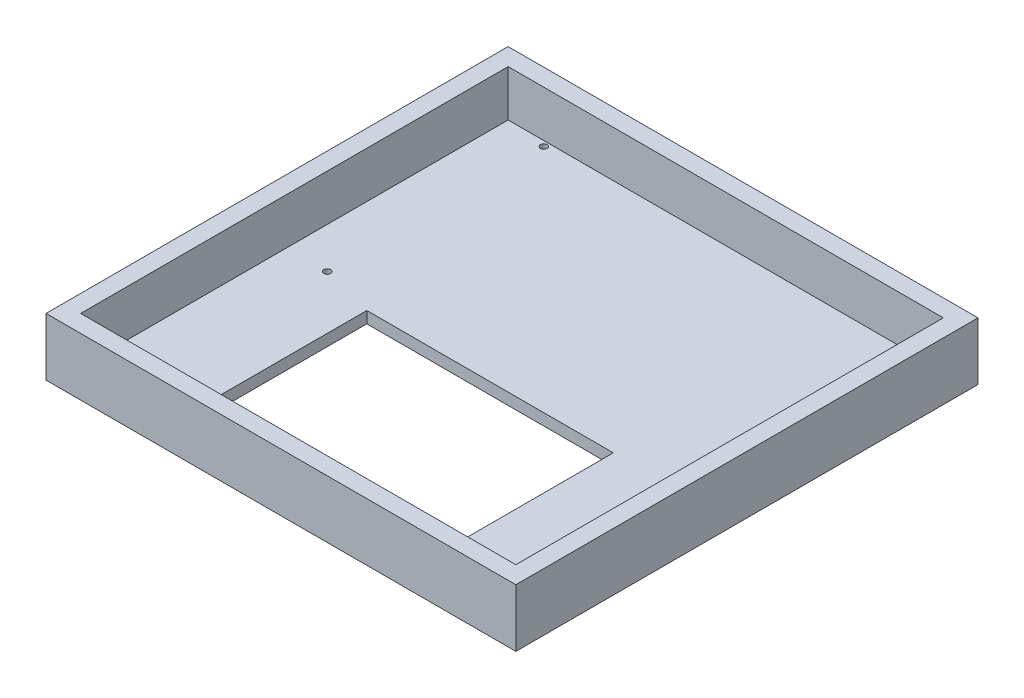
from build123d import *

# Parameters (mm, degrees)
SKETCH1_W                  = 122
SKETCH1_H                  = 120
BOSS_EXTRUDE1_DEPTH        = 15
SKETCH2_W                  = 113
SKETCH2_H                  = 111
CUT_EXTRUDE_BACK_DEPTH     = 12
SKETCH6_W                  = 64
SKETCH6_H                  = 46
CUT_EXTRUDE_TRF7970A_DEPTH = 87.867715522
SKETCH8_R                  = 0.8763
CUT_EXTRUDE2_DEPTH         = 87.400231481


with BuildPart() as part:
    # Sketch1 → Boss-Extrude1 (new body)
    with BuildSketch(Plane(origin=(0, 0, 0), x_dir=(1, 0, 0), z_dir=(0, 1, 0))):
        Rectangle(SKETCH1_W, SKETCH1_H)
    extrude(amount=BOSS_EXTRUDE1_DEPTH)

    # Sketch2 → Cut-Extrude_BACK (cut)
    with BuildSketch(Plane(origin=(0, 15, 0), x_dir=(1, 0, 0), z_dir=(0, 1, 0))):
        Rectangle(SKETCH2_W, SKETCH2_H)
    extrude(amount=-CUT_EXTRUDE_BACK_DEPTH, mode=Mode.SUBTRACT)

    # Sketch6 → Cut-Extrude_TRF7970A (cut, through all)
    with BuildSketch(Plane(origin=(0, 0, 0), x_dir=(-1, 0, 0), z_dir=(0, -1, 0))):
        with Locations((0, -28.6942)):
            Rectangle(SKETCH6_W, SKETCH6_H)
    extrude(amount=-CUT_EXTRUDE_TRF7970A_DEPTH, mode=Mode.SUBTRACT)

    # Sketch8 → Cut-Extrude2 (cut, through all)
    with BuildSketch(Plane(origin=(0, 3, 0), x_dir=(1, 0, 0), z_dir=(0, 1, 0))):
        with Locations(Location((-45.8978, 54.1736, 0), (0, 0, 270))):
            Circle(SKETCH8_R)
        with Locations(Location((-45.8978, -2.062, 0), (0, 0, 270))):
            Circle(SKETCH8_R)
        with Locations(Location((45.8978, -2.062, 0), (0, 0, 270))):
            Circle(SKETCH8_R)
        with Locations(Location((45.8978, 54.1736, 0), (0, 0, 270))):
            Circle(SKETCH8_R)
    extrude(amount=-CUT_EXTRUDE2_DEPTH, mode=Mode.SUBTRACT)


solid = part.part
